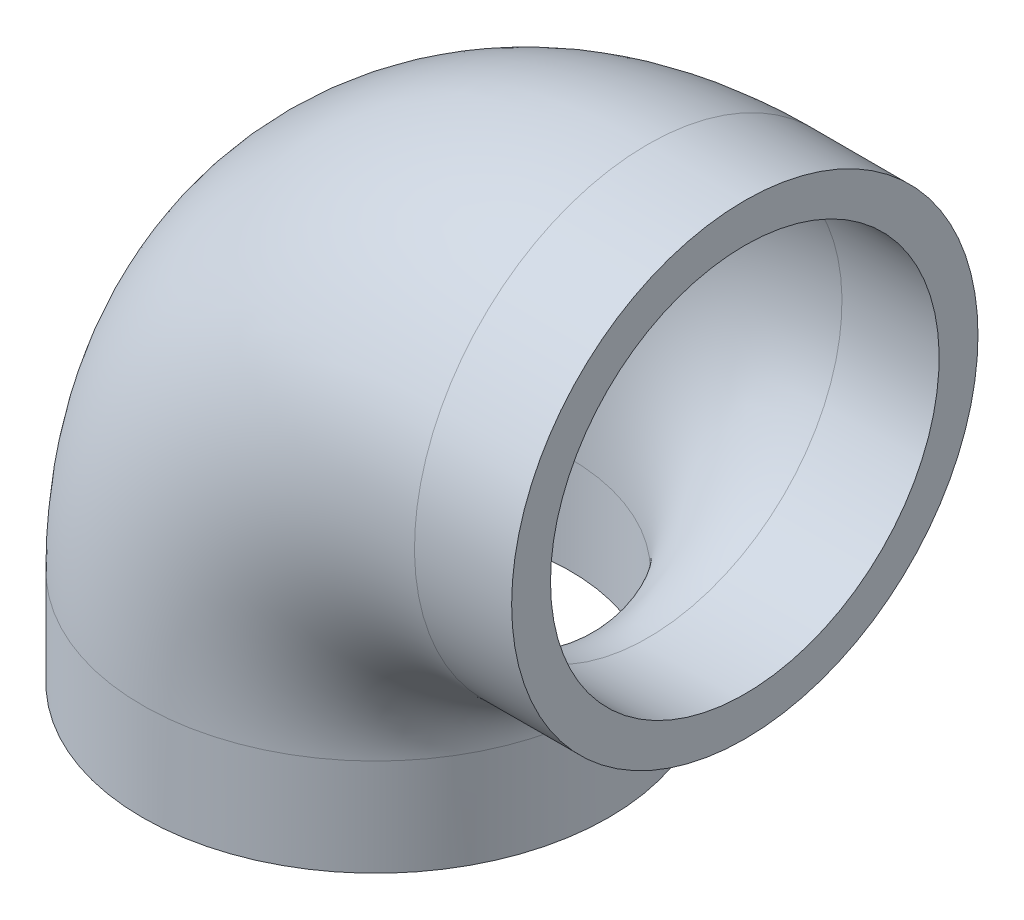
ISO-10303-21;
HEADER;
FILE_DESCRIPTION(('STEP AP214'),'2;1');
FILE_NAME('part.step','',(''),(''),'','','');
FILE_SCHEMA(('AUTOMOTIVE_DESIGN { 1 0 10303 214 1 1 1 1 }'));
ENDSEC;
DATA;
#1=APPLICATION_CONTEXT('core data for automotive mechanical design processes');
#2=APPLICATION_PROTOCOL_DEFINITION('international standard','automotive_design',2000,#1);
#3=PRODUCT_CONTEXT('',#1,'mechanical');
#4=PRODUCT('Part','Part','',(#3));
#5=PRODUCT_RELATED_PRODUCT_CATEGORY('part','',(#4));
#6=PRODUCT_DEFINITION_FORMATION('','',#4);
#7=PRODUCT_DEFINITION_CONTEXT('part definition',#1,'design');
#8=PRODUCT_DEFINITION('design','',#6,#7);
#9=PRODUCT_DEFINITION_SHAPE('','',#8);
#10=(LENGTH_UNIT() NAMED_UNIT(*) SI_UNIT(.MILLI.,.METRE.));
#11=(NAMED_UNIT(*) PLANE_ANGLE_UNIT() SI_UNIT($,.RADIAN.));
#12=(NAMED_UNIT(*) SI_UNIT($,.STERADIAN.) SOLID_ANGLE_UNIT());
#13=UNCERTAINTY_MEASURE_WITH_UNIT(LENGTH_MEASURE(1.E-05),#10,'distance_accuracy_value','');
#14=(GEOMETRIC_REPRESENTATION_CONTEXT(3) GLOBAL_UNCERTAINTY_ASSIGNED_CONTEXT((#13)) GLOBAL_UNIT_ASSIGNED_CONTEXT((#10,
#11,#12)) REPRESENTATION_CONTEXT('',''));
#15=CARTESIAN_POINT('',(0.,0.,0.));
#16=DIRECTION('',(0.,0.,1.));
#17=DIRECTION('',(1.,0.,0.));
#18=AXIS2_PLACEMENT_3D('',#15,#16,#17);
#19=CARTESIAN_POINT('',(17.78,24.13,0.));
#20=DIRECTION('',(1.,0.,0.));
#21=DIRECTION('',(0.,1.,0.));
#22=AXIS2_PLACEMENT_3D('',#19,#20,#21);
#23=CYLINDRICAL_SURFACE('',#22,15.24);
#24=CARTESIAN_POINT('',(17.78,24.13,0.));
#25=DIRECTION('',(1.,0.,0.));
#26=DIRECTION('',(0.,0.,1.));
#27=AXIS2_PLACEMENT_3D('',#24,#25,#26);
#28=CIRCLE('',#27,15.24);
#29=CARTESIAN_POINT('',(17.78,39.37,0.));
#30=VERTEX_POINT('',#29);
#31=EDGE_CURVE('E40',#30,#30,#28,.T.);
#32=ORIENTED_EDGE('',*,*,#31,.T.);
#33=EDGE_LOOP('',(#32));
#34=FACE_BOUND('',#33,.T.);
#35=CARTESIAN_POINT('',(24.13,24.13,0.));
#36=DIRECTION('',(1.,0.,0.));
#37=DIRECTION('',(0.,0.,1.));
#38=AXIS2_PLACEMENT_3D('',#35,#36,#37);
#39=CIRCLE('',#38,15.24);
#40=CARTESIAN_POINT('',(24.13,24.13,15.24));
#41=VERTEX_POINT('',#40);
#42=EDGE_CURVE('E10',#41,#41,#39,.T.);
#43=ORIENTED_EDGE('',*,*,#42,.F.);
#44=EDGE_LOOP('',(#43));
#45=FACE_BOUND('',#44,.T.);
#46=ADVANCED_FACE('F30',(#34,#45),#23,.T.);
#47=CARTESIAN_POINT('',(17.78,24.13,0.));
#48=DIRECTION('',(1.,0.,0.));
#49=DIRECTION('',(0.,1.,0.));
#50=AXIS2_PLACEMENT_3D('',#47,#48,#49);
#51=CYLINDRICAL_SURFACE('',#50,12.7);
#52=CARTESIAN_POINT('',(17.78,24.13,0.));
#53=DIRECTION('',(1.,0.,0.));
#54=DIRECTION('',(0.,0.,1.));
#55=AXIS2_PLACEMENT_3D('',#52,#53,#54);
#56=CIRCLE('',#55,12.7);
#57=CARTESIAN_POINT('',(17.78,36.83,0.));
#58=VERTEX_POINT('',#57);
#59=EDGE_CURVE('E44',#58,#58,#56,.T.);
#60=ORIENTED_EDGE('',*,*,#59,.F.);
#61=EDGE_LOOP('',(#60));
#62=FACE_BOUND('',#61,.T.);
#63=CARTESIAN_POINT('',(24.13,24.13,0.));
#64=DIRECTION('',(1.,0.,0.));
#65=DIRECTION('',(0.,0.,1.));
#66=AXIS2_PLACEMENT_3D('',#63,#64,#65);
#67=CIRCLE('',#66,12.7);
#68=CARTESIAN_POINT('',(24.13,24.13,12.7));
#69=VERTEX_POINT('',#68);
#70=EDGE_CURVE('E36',#69,#69,#67,.T.);
#71=ORIENTED_EDGE('',*,*,#70,.T.);
#72=EDGE_LOOP('',(#71));
#73=FACE_BOUND('',#72,.T.);
#74=ADVANCED_FACE('F72',(#62,#73),#51,.F.);
#75=CARTESIAN_POINT('',(17.78,6.35,0.));
#76=DIRECTION('',(0.,0.,-1.));
#77=DIRECTION('',(-1.,0.,0.));
#78=AXIS2_PLACEMENT_3D('',#75,#76,#77);
#79=TOROIDAL_SURFACE('',#78,17.78,15.24);
#80=CARTESIAN_POINT('',(0.,6.35,0.));
#81=DIRECTION('',(0.,1.,0.));
#82=DIRECTION('',(0.,0.,1.));
#83=AXIS2_PLACEMENT_3D('',#80,#81,#82);
#84=CIRCLE('',#83,15.24);
#85=CARTESIAN_POINT('',(-15.24,6.35,0.));
#86=VERTEX_POINT('',#85);
#87=EDGE_CURVE('E49',#86,#86,#84,.T.);
#88=CARTESIAN_POINT('',(17.78,6.35,0.));
#89=DIRECTION('',(0.,0.,-1.));
#90=DIRECTION('',(-1.,0.,0.));
#91=AXIS2_PLACEMENT_3D('',#88,#89,#90);
#92=CIRCLE('',#91,33.02);
#93=EDGE_CURVE('',#86,#30,#92,.T.);
#94=ORIENTED_EDGE('',*,*,#87,.T.);
#95=ORIENTED_EDGE('',*,*,#31,.F.);
#96=ORIENTED_EDGE('',*,*,#93,.T.);
#97=ORIENTED_EDGE('',*,*,#93,.F.);
#98=EDGE_LOOP('',(#94,#96,#95,#97));
#99=FACE_BOUND('',#98,.T.);
#100=ADVANCED_FACE('F68',(#99),#79,.T.);
#101=CARTESIAN_POINT('',(17.78,6.35,0.));
#102=DIRECTION('',(0.,0.,-1.));
#103=DIRECTION('',(-1.,0.,0.));
#104=AXIS2_PLACEMENT_3D('',#101,#102,#103);
#105=TOROIDAL_SURFACE('',#104,17.78,12.7);
#106=CARTESIAN_POINT('',(0.,6.35,0.));
#107=DIRECTION('',(0.,1.,0.));
#108=DIRECTION('',(0.,0.,1.));
#109=AXIS2_PLACEMENT_3D('',#106,#107,#108);
#110=CIRCLE('',#109,12.7);
#111=CARTESIAN_POINT('',(-12.7,6.35,0.));
#112=VERTEX_POINT('',#111);
#113=EDGE_CURVE('E53',#112,#112,#110,.T.);
#114=CARTESIAN_POINT('',(17.78,6.35,0.));
#115=DIRECTION('',(0.,0.,-1.));
#116=DIRECTION('',(-1.,0.,0.));
#117=AXIS2_PLACEMENT_3D('',#114,#115,#116);
#118=CIRCLE('',#117,30.48);
#119=EDGE_CURVE('',#112,#58,#118,.T.);
#120=ORIENTED_EDGE('',*,*,#113,.F.);
#121=ORIENTED_EDGE('',*,*,#59,.T.);
#122=ORIENTED_EDGE('',*,*,#119,.T.);
#123=ORIENTED_EDGE('',*,*,#119,.F.);
#124=EDGE_LOOP('',(#120,#122,#121,#123));
#125=FACE_BOUND('',#124,.T.);
#126=ADVANCED_FACE('F65',(#125),#105,.F.);
#127=CARTESIAN_POINT('',(0.,6.35,0.));
#128=DIRECTION('',(0.,-1.,0.));
#129=DIRECTION('',(0.,0.,-1.));
#130=AXIS2_PLACEMENT_3D('',#127,#128,#129);
#131=CYLINDRICAL_SURFACE('',#130,12.7);
#132=ORIENTED_EDGE('',*,*,#113,.T.);
#133=EDGE_LOOP('',(#132));
#134=FACE_BOUND('',#133,.T.);
#135=CARTESIAN_POINT('',(0.,0.,0.));
#136=DIRECTION('',(0.,1.,0.));
#137=DIRECTION('',(0.,0.,1.));
#138=AXIS2_PLACEMENT_3D('',#135,#136,#137);
#139=CIRCLE('',#138,12.7);
#140=CARTESIAN_POINT('',(0.,0.,12.7));
#141=VERTEX_POINT('',#140);
#142=EDGE_CURVE('E54',#141,#141,#139,.T.);
#143=ORIENTED_EDGE('',*,*,#142,.F.);
#144=EDGE_LOOP('',(#143));
#145=FACE_BOUND('',#144,.T.);
#146=ADVANCED_FACE('F62',(#134,#145),#131,.F.);
#147=CARTESIAN_POINT('',(0.,6.35,0.));
#148=DIRECTION('',(0.,-1.,0.));
#149=DIRECTION('',(0.,0.,-1.));
#150=AXIS2_PLACEMENT_3D('',#147,#148,#149);
#151=CYLINDRICAL_SURFACE('',#150,15.24);
#152=ORIENTED_EDGE('',*,*,#87,.F.);
#153=EDGE_LOOP('',(#152));
#154=FACE_BOUND('',#153,.T.);
#155=CARTESIAN_POINT('',(0.,0.,0.));
#156=DIRECTION('',(0.,1.,0.));
#157=DIRECTION('',(0.,0.,1.));
#158=AXIS2_PLACEMENT_3D('',#155,#156,#157);
#159=CIRCLE('',#158,15.24);
#160=CARTESIAN_POINT('',(0.,0.,15.24));
#161=VERTEX_POINT('',#160);
#162=EDGE_CURVE('E50',#161,#161,#159,.T.);
#163=ORIENTED_EDGE('',*,*,#162,.T.);
#164=EDGE_LOOP('',(#163));
#165=FACE_BOUND('',#164,.T.);
#166=ADVANCED_FACE('F84',(#154,#165),#151,.T.);
#167=CARTESIAN_POINT('',(24.13,24.13,0.));
#168=DIRECTION('',(1.,0.,0.));
#169=DIRECTION('',(0.,0.,1.));
#170=AXIS2_PLACEMENT_3D('',#167,#168,#169);
#171=PLANE('',#170);
#172=ORIENTED_EDGE('',*,*,#70,.F.);
#173=EDGE_LOOP('',(#172));
#174=FACE_BOUND('',#173,.T.);
#175=ORIENTED_EDGE('',*,*,#42,.T.);
#176=EDGE_LOOP('',(#175));
#177=FACE_BOUND('',#176,.T.);
#178=ADVANCED_FACE('F87',(#174,#177),#171,.T.);
#179=CARTESIAN_POINT('',(0.,0.,0.));
#180=DIRECTION('',(0.,1.,0.));
#181=DIRECTION('',(0.,0.,1.));
#182=AXIS2_PLACEMENT_3D('',#179,#180,#181);
#183=PLANE('',#182);
#184=ORIENTED_EDGE('',*,*,#142,.T.);
#185=EDGE_LOOP('',(#184));
#186=FACE_BOUND('',#185,.T.);
#187=ORIENTED_EDGE('',*,*,#162,.F.);
#188=EDGE_LOOP('',(#187));
#189=FACE_BOUND('',#188,.T.);
#190=ADVANCED_FACE('F89',(#186,#189),#183,.F.);
#191=CLOSED_SHELL('',(#46,#74,#100,#126,#146,#166,#178,#190));
#192=MANIFOLD_SOLID_BREP('B2',#191);
#193=ADVANCED_BREP_SHAPE_REPRESENTATION('',(#18,#192),#14);
#194=SHAPE_DEFINITION_REPRESENTATION(#9,#193);
ENDSEC;
END-ISO-10303-21;
